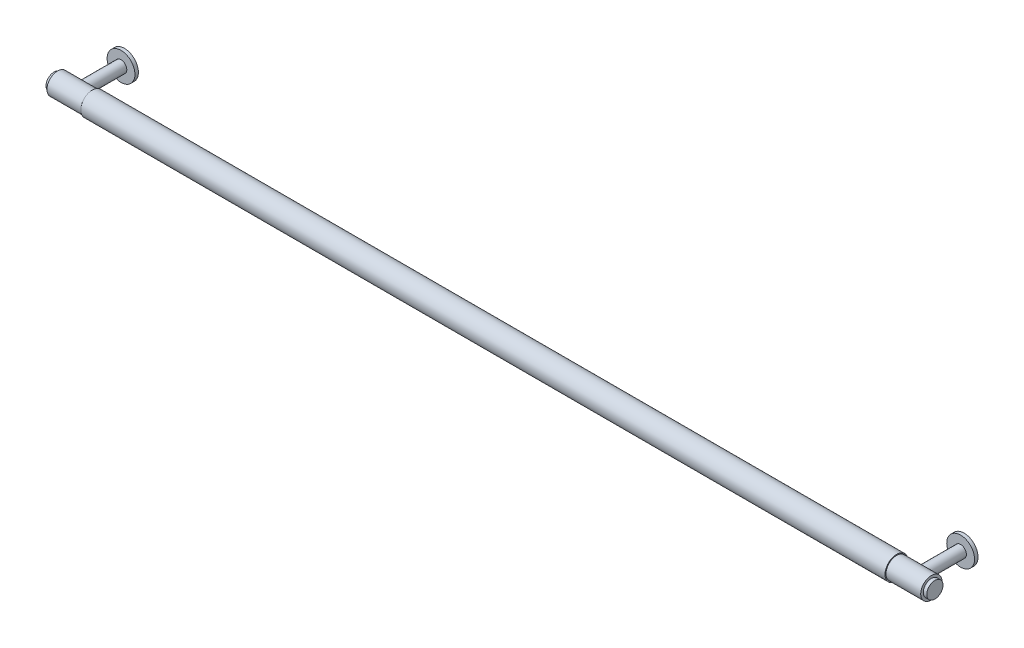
ISO-10303-21;
HEADER;
FILE_DESCRIPTION(('STEP AP214'),'2;1');
FILE_NAME('part.step','',(''),(''),'','','');
FILE_SCHEMA(('AUTOMOTIVE_DESIGN { 1 0 10303 214 1 1 1 1 }'));
ENDSEC;
DATA;
#1=APPLICATION_CONTEXT('core data for automotive mechanical design processes');
#2=APPLICATION_PROTOCOL_DEFINITION('international standard','automotive_design',2000,#1);
#3=PRODUCT_CONTEXT('',#1,'mechanical');
#4=PRODUCT('Part','Part','',(#3));
#5=PRODUCT_RELATED_PRODUCT_CATEGORY('part','',(#4));
#6=PRODUCT_DEFINITION_FORMATION('','',#4);
#7=PRODUCT_DEFINITION_CONTEXT('part definition',#1,'design');
#8=PRODUCT_DEFINITION('design','',#6,#7);
#9=PRODUCT_DEFINITION_SHAPE('','',#8);
#10=(LENGTH_UNIT() NAMED_UNIT(*) SI_UNIT(.MILLI.,.METRE.));
#11=(NAMED_UNIT(*) PLANE_ANGLE_UNIT() SI_UNIT($,.RADIAN.));
#12=(NAMED_UNIT(*) SI_UNIT($,.STERADIAN.) SOLID_ANGLE_UNIT());
#13=UNCERTAINTY_MEASURE_WITH_UNIT(LENGTH_MEASURE(1.E-05),#10,'distance_accuracy_value','');
#14=(GEOMETRIC_REPRESENTATION_CONTEXT(3) GLOBAL_UNCERTAINTY_ASSIGNED_CONTEXT((#13)) GLOBAL_UNIT_ASSIGNED_CONTEXT((#10,
#11,#12)) REPRESENTATION_CONTEXT('',''));
#15=CARTESIAN_POINT('',(0.,0.,0.));
#16=DIRECTION('',(0.,0.,1.));
#17=DIRECTION('',(1.,0.,0.));
#18=AXIS2_PLACEMENT_3D('',#15,#16,#17);
#19=CARTESIAN_POINT('',(377.,0.,0.));
#20=DIRECTION('',(-1.,0.,0.));
#21=DIRECTION('',(0.,0.,1.));
#22=AXIS2_PLACEMENT_3D('',#19,#20,#21);
#23=CYLINDRICAL_SURFACE('',#22,9.2);
#24=CARTESIAN_POINT('',(347.,0.,0.));
#25=DIRECTION('',(1.,0.,0.));
#26=DIRECTION('',(0.,0.,-1.));
#27=AXIS2_PLACEMENT_3D('',#24,#25,#26);
#28=CIRCLE('',#27,9.2);
#29=CARTESIAN_POINT('',(347.,0.,-9.2));
#30=VERTEX_POINT('',#29);
#31=EDGE_CURVE('E110',#30,#30,#28,.T.);
#32=ORIENTED_EDGE('',*,*,#31,.T.);
#33=EDGE_LOOP('',(#32));
#34=FACE_BOUND('',#33,.T.);
#35=CARTESIAN_POINT('',(377.,0.,0.));
#36=DIRECTION('',(1.,0.,0.));
#37=DIRECTION('',(0.,0.,-1.));
#38=AXIS2_PLACEMENT_3D('',#35,#36,#37);
#39=CIRCLE('',#38,9.2);
#40=CARTESIAN_POINT('',(377.,0.,-9.2));
#41=VERTEX_POINT('',#40);
#42=EDGE_CURVE('E111',#41,#41,#39,.T.);
#43=ORIENTED_EDGE('',*,*,#42,.F.);
#44=EDGE_LOOP('',(#43));
#45=FACE_BOUND('',#44,.T.);
#46=CARTESIAN_POINT('',(367.25,0.,-9.2));
#47=CARTESIAN_POINT('',(367.250001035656,-0.130074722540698,-9.20000090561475));
#48=CARTESIAN_POINT('',(367.244919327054,-0.260136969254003,-9.19723589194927));
#49=CARTESIAN_POINT('',(367.224659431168,-0.519285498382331,-9.18624856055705));
#50=CARTESIAN_POINT('',(367.209478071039,-0.648371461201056,-9.17802452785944));
#51=CARTESIAN_POINT('',(367.169189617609,-0.904665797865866,-9.15631689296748));
#52=CARTESIAN_POINT('',(367.144072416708,-1.03187212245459,-9.14282793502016));
#53=CARTESIAN_POINT('',(367.084208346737,-1.28341476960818,-9.11092364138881));
#54=CARTESIAN_POINT('',(367.04945754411,-1.40774989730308,-9.0925062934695));
#55=CARTESIAN_POINT('',(366.970895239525,-1.65213298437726,-9.05128374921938));
#56=CARTESIAN_POINT('',(366.927125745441,-1.77219789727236,-9.02849892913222));
#57=CARTESIAN_POINT('',(366.830864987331,-2.00796183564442,-8.9790104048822));
#58=CARTESIAN_POINT('',(366.778370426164,-2.12365919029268,-8.95230521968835));
#59=CARTESIAN_POINT('',(366.608525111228,-2.46316888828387,-8.86719116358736));
#60=CARTESIAN_POINT('',(366.478734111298,-2.67964052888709,-8.80374126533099));
#61=CARTESIAN_POINT('',(366.179944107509,-3.10276985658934,-8.66405646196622));
#62=CARTESIAN_POINT('',(366.008884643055,-3.30776927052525,-8.58724663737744));
#63=CARTESIAN_POINT('',(365.636938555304,-3.68774436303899,-8.4310608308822));
#64=CARTESIAN_POINT('',(365.436025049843,-3.86269267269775,-8.35168258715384));
#65=CARTESIAN_POINT('',(364.986960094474,-4.19453179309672,-8.19042783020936));
#66=CARTESIAN_POINT('',(364.736128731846,-4.34809630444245,-8.10903821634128));
#67=CARTESIAN_POINT('',(364.340003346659,-4.54463175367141,-7.99949849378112));
#68=CARTESIAN_POINT('',(364.204600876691,-4.60452242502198,-7.96506681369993));
#69=CARTESIAN_POINT('',(363.927917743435,-4.71238739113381,-7.90172843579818));
#70=CARTESIAN_POINT('',(363.786640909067,-4.76036931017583,-7.87281820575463));
#71=CARTESIAN_POINT('',(363.508188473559,-4.84114175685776,-7.82339132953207));
#72=CARTESIAN_POINT('',(363.371306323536,-4.87469290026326,-7.80246375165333));
#73=CARTESIAN_POINT('',(363.094408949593,-4.9302019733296,-7.76750851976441));
#74=CARTESIAN_POINT('',(362.954395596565,-4.95216664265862,-7.75347685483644));
#75=CARTESIAN_POINT('',(362.67258350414,-4.98412633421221,-7.73297147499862));
#76=CARTESIAN_POINT('',(362.530786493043,-4.99413215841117,-7.72649093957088));
#77=CARTESIAN_POINT('',(362.246722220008,-5.0020165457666,-7.72138953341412));
#78=CARTESIAN_POINT('',(362.104455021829,-4.99989669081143,-7.72276763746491));
#79=CARTESIAN_POINT('',(361.841925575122,-4.98478878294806,-7.73252471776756));
#80=CARTESIAN_POINT('',(361.721523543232,-4.97345607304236,-7.73983711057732));
#81=CARTESIAN_POINT('',(361.482260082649,-4.94217921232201,-7.75984601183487));
#82=CARTESIAN_POINT('',(361.363399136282,-4.92223242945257,-7.77254416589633));
#83=CARTESIAN_POINT('',(361.12803831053,-4.87397481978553,-7.80289558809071));
#84=CARTESIAN_POINT('',(361.011538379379,-4.84566417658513,-7.82054874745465));
#85=CARTESIAN_POINT('',(360.781543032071,-4.7809962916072,-7.86024868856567));
#86=CARTESIAN_POINT('',(360.668048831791,-4.7446358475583,-7.88229721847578));
#87=CARTESIAN_POINT('',(360.328154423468,-4.62225510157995,-7.95511924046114));
#88=CARTESIAN_POINT('',(360.107319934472,-4.52396510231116,-8.01188661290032));
#89=CARTESIAN_POINT('',(359.684260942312,-4.29821090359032,-8.1352249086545));
#90=CARTESIAN_POINT('',(359.482044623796,-4.17073395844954,-8.2018001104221));
#91=CARTESIAN_POINT('',(359.069163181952,-3.86749973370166,-8.34955553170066));
#92=CARTESIAN_POINT('',(358.86196454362,-3.68733528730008,-8.43140910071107));
#93=CARTESIAN_POINT('',(358.479057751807,-3.29471585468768,-8.59242600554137));
#94=CARTESIAN_POINT('',(358.303370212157,-3.08223989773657,-8.67158755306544));
#95=CARTESIAN_POINT('',(358.061812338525,-2.73508983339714,-8.78495686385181));
#96=CARTESIAN_POINT('',(357.982990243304,-2.61045949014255,-8.82288451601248));
#97=CARTESIAN_POINT('',(357.836257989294,-2.35386813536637,-8.89477478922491));
#98=CARTESIAN_POINT('',(357.768343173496,-2.22191028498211,-8.92873910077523));
#99=CARTESIAN_POINT('',(357.644183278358,-1.95155644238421,-8.99170105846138));
#100=CARTESIAN_POINT('',(357.587932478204,-1.81316364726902,-9.02070113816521));
#101=CARTESIAN_POINT('',(357.487782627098,-1.53091383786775,-9.07286528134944));
#102=CARTESIAN_POINT('',(357.443881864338,-1.38705758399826,-9.09603015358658));
#103=CARTESIAN_POINT('',(357.372513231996,-1.10853590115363,-9.13395050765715));
#104=CARTESIAN_POINT('',(357.343906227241,-0.97424021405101,-9.14928303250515));
#105=CARTESIAN_POINT('',(357.297792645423,-0.70322778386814,-9.17409277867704));
#106=CARTESIAN_POINT('',(357.280284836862,-0.56651131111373,-9.18357064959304));
#107=CARTESIAN_POINT('',(357.256625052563,-0.291879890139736,-9.19639574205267));
#108=CARTESIAN_POINT('',(357.250467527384,-0.153965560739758,-9.19974595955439));
#109=CARTESIAN_POINT('',(357.249583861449,0.121906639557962,-9.20022611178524));
#110=CARTESIAN_POINT('',(357.25485701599,0.259864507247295,-9.19735642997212));
#111=CARTESIAN_POINT('',(357.275708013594,0.521504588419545,-9.18605000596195));
#112=CARTESIAN_POINT('',(357.290256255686,0.645294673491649,-9.17816969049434));
#113=CARTESIAN_POINT('',(357.328472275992,0.891088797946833,-9.15757479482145));
#114=CARTESIAN_POINT('',(357.352142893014,1.01309226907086,-9.1448587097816));
#115=CARTESIAN_POINT('',(357.408333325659,1.25443425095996,-9.11488727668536));
#116=CARTESIAN_POINT('',(357.440850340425,1.37377359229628,-9.09763336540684));
#117=CARTESIAN_POINT('',(357.514396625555,1.60912592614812,-9.05897178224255));
#118=CARTESIAN_POINT('',(357.555429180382,1.72513761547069,-9.0375625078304));
#119=CARTESIAN_POINT('',(357.692832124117,2.07244825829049,-8.9666859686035));
#120=CARTESIAN_POINT('',(357.80222449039,2.29754525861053,-8.91127618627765));
#121=CARTESIAN_POINT('',(358.051555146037,2.72668339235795,-8.78949008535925));
#122=CARTESIAN_POINT('',(358.191504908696,2.93071657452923,-8.72310964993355));
#123=CARTESIAN_POINT('',(358.515646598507,3.33604084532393,-8.5768397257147));
#124=CARTESIAN_POINT('',(358.703016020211,3.53454639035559,-8.49626779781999));
#125=CARTESIAN_POINT('',(359.107841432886,3.89884933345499,-8.33538773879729));
#126=CARTESIAN_POINT('',(359.325327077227,4.06461409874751,-8.25507994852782));
#127=CARTESIAN_POINT('',(359.679615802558,4.29124185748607,-8.13837911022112));
#128=CARTESIAN_POINT('',(359.807207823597,4.36516170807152,-8.0988551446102));
#129=CARTESIAN_POINT('',(360.069309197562,4.50182228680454,-8.02369412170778));
#130=CARTESIAN_POINT('',(360.203815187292,4.56456838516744,-7.98805520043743));
#131=CARTESIAN_POINT('',(360.478867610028,4.67816332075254,-7.92206455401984));
#132=CARTESIAN_POINT('',(360.619408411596,4.72902297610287,-7.89170802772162));
#133=CARTESIAN_POINT('',(360.905644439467,4.81821167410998,-7.83757391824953));
#134=CARTESIAN_POINT('',(361.051338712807,4.85654302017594,-7.81379512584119));
#135=CARTESIAN_POINT('',(361.332218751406,4.91693572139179,-7.77591708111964));
#136=CARTESIAN_POINT('',(361.467045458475,4.94021834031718,-7.76110050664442));
#137=CARTESIAN_POINT('',(361.738723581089,4.9756762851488,-7.7384167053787));
#138=CARTESIAN_POINT('',(361.875574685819,4.98785329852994,-7.73054842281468));
#139=CARTESIAN_POINT('',(362.149954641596,5.00088423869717,-7.72212521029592));
#140=CARTESIAN_POINT('',(362.287483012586,5.0017452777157,-7.72156568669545));
#141=CARTESIAN_POINT('',(362.561968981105,4.99214702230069,-7.72777464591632));
#142=CARTESIAN_POINT('',(362.698926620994,4.98168858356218,-7.73454257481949));
#143=CARTESIAN_POINT('',(362.953194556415,4.95173663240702,-7.7537456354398));
#144=CARTESIAN_POINT('',(363.070732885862,4.93360287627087,-7.7653243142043));
#145=CARTESIAN_POINT('',(363.303669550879,4.88915719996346,-7.79338335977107));
#146=CARTESIAN_POINT('',(363.419067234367,4.86284282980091,-7.8098651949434));
#147=CARTESIAN_POINT('',(363.760997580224,4.77204459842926,-7.86592091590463));
#148=CARTESIAN_POINT('',(363.983409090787,4.69568852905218,-7.91211668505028));
#149=CARTESIAN_POINT('',(364.426159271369,4.50841400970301,-8.02038246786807));
#150=CARTESIAN_POINT('',(364.64549505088,4.3956298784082,-8.08326570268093));
#151=CARTESIAN_POINT('',(365.063636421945,4.14046696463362,-8.21688922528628));
#152=CARTESIAN_POINT('',(365.262430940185,3.99807234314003,-8.28763370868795));
#153=CARTESIAN_POINT('',(365.665342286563,3.66254871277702,-8.44184811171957));
#154=CARTESIAN_POINT('',(365.86567297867,3.46499766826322,-8.52561746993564));
#155=CARTESIAN_POINT('',(366.231654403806,3.03735701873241,-8.68715056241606));
#156=CARTESIAN_POINT('',(366.397281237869,2.8072451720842,-8.76491013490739));
#157=CARTESIAN_POINT('',(366.61800821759,2.43762496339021,-8.87216065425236));
#158=CARTESIAN_POINT('',(366.687800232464,2.30818012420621,-8.90679581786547));
#159=CARTESIAN_POINT('',(366.816072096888,2.04271439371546,-8.97139528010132));
#160=CARTESIAN_POINT('',(366.874557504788,1.90669677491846,-9.00136187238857));
#161=CARTESIAN_POINT('',(366.979411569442,1.62929850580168,-9.05567934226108));
#162=CARTESIAN_POINT('',(367.025803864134,1.48792894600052,-9.0800411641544));
#163=CARTESIAN_POINT('',(367.10595335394,1.20079805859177,-9.12245171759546));
#164=CARTESIAN_POINT('',(367.139717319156,1.05503912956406,-9.1405038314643));
#165=CARTESIAN_POINT('',(367.194445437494,0.758588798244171,-9.16989641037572));
#166=CARTESIAN_POINT('',(367.215246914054,0.607858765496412,-9.18115152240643));
#167=CARTESIAN_POINT('',(367.243023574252,0.304746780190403,-9.19620277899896));
#168=CARTESIAN_POINT('',(367.24999878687,0.152364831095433,-9.1999989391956));
#169=CARTESIAN_POINT('',(367.25,0.,-9.2));
#170=B_SPLINE_CURVE_WITH_KNOTS('',3,(#46,#47,#48,#49,#50,#51,#52,#53,#54,#55,#56,#57,#58,#59,
#60,#61,#62,#63,#64,#65,#66,#67,#68,#69,#70,#71,#72,#73,#74,#75,#76,#77,#78,#79,#80,#81,#82,#83,
#84,#85,#86,#87,#88,#89,#90,#91,#92,#93,#94,#95,#96,#97,#98,#99,#100,#101,#102,#103,#104,#105,
#106,#107,#108,#109,#110,#111,#112,#113,#114,#115,#116,#117,#118,#119,#120,#121,#122,#123,#124,
#125,#126,#127,#128,#129,#130,#131,#132,#133,#134,#135,#136,#137,#138,#139,#140,#141,#142,#143,
#144,#145,#146,#147,#148,#149,#150,#151,#152,#153,#154,#155,#156,#157,#158,#159,#160,#161,#162,
#163,#164,#165,#166,#167,#168,#169),.UNSPECIFIED.,.T.,.F.,(4,2,2,2,2,2,2,2,2,2,2,2,2,2,2,2,2,2,
2,2,2,2,2,2,2,2,2,2,2,2,2,2,2,2,2,2,2,2,2,2,2,2,2,2,2,2,2,2,2,2,2,2,2,2,2,2,2,2,2,2,2,4),(0.,
0.390074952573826,0.780272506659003,1.17086802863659,1.56162327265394,1.9505979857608,
2.33972002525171,3.11719990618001,3.94734927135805,4.77825072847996,5.68860389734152,
6.1440790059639,6.59926175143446,7.02606566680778,7.45262104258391,7.87879083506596,
8.30490503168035,8.66793889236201,9.03108375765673,9.39422065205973,9.75750226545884,
10.4992817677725,11.2413858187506,12.0973849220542,12.9539419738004,13.4102132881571,
13.8662892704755,14.3221410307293,14.7779295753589,15.1918463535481,15.6057171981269,
16.0193856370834,16.4330285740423,16.8072633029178,17.1816145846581,17.5558474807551,
17.9302249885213,18.6957960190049,19.4616549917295,20.3120011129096,21.1631905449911,
21.6206680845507,22.0779251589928,22.5347644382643,22.9915196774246,23.4037762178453,
23.815970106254,24.2279049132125,24.6398085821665,24.9978688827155,25.3560365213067,
26.0719476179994,26.8327119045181,27.5938841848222,28.4707847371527,29.3482872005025,
29.8010085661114,30.2535068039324,30.7051138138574,31.1564783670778,31.6133990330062,
32.0703187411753),.UNSPECIFIED.);
#171=CARTESIAN_POINT('',(367.25,0.,-9.2));
#172=VERTEX_POINT('',#171);
#173=EDGE_CURVE('E10',#172,#172,#170,.T.);
#174=ORIENTED_EDGE('',*,*,#173,.F.);
#175=EDGE_LOOP('',(#174));
#176=FACE_BOUND('',#175,.T.);
#177=ADVANCED_FACE('F31',(#34,#45,#176),#23,.T.);
#178=CARTESIAN_POINT('',(377.,0.,0.));
#179=DIRECTION('',(1.,0.,0.));
#180=DIRECTION('',(0.,0.,-1.));
#181=AXIS2_PLACEMENT_3D('',#178,#179,#180);
#182=PLANE('',#181);
#183=ORIENTED_EDGE('',*,*,#42,.T.);
#184=EDGE_LOOP('',(#183));
#185=FACE_BOUND('',#184,.T.);
#186=CARTESIAN_POINT('',(377.,0.,0.));
#187=DIRECTION('',(1.,0.,0.));
#188=DIRECTION('',(0.,0.,-1.));
#189=AXIS2_PLACEMENT_3D('',#186,#187,#188);
#190=CIRCLE('',#189,7.);
#191=CARTESIAN_POINT('',(377.,0.,-7.));
#192=VERTEX_POINT('',#191);
#193=EDGE_CURVE('E117',#192,#192,#190,.T.);
#194=ORIENTED_EDGE('',*,*,#193,.F.);
#195=EDGE_LOOP('',(#194));
#196=FACE_BOUND('',#195,.T.);
#197=ADVANCED_FACE('F86',(#185,#196),#182,.T.);
#198=CARTESIAN_POINT('',(347.,0.,0.));
#199=DIRECTION('',(1.,0.,0.));
#200=DIRECTION('',(0.,0.,-1.));
#201=AXIS2_PLACEMENT_3D('',#198,#199,#200);
#202=PLANE('',#201);
#203=CARTESIAN_POINT('',(347.,0.,0.));
#204=DIRECTION('',(1.,0.,0.));
#205=DIRECTION('',(0.,0.,-1.));
#206=AXIS2_PLACEMENT_3D('',#203,#204,#205);
#207=CIRCLE('',#206,10.);
#208=CARTESIAN_POINT('',(347.,0.,-10.));
#209=VERTEX_POINT('',#208);
#210=EDGE_CURVE('E108',#209,#209,#207,.T.);
#211=ORIENTED_EDGE('',*,*,#210,.T.);
#212=EDGE_LOOP('',(#211));
#213=FACE_BOUND('',#212,.T.);
#214=ORIENTED_EDGE('',*,*,#31,.F.);
#215=EDGE_LOOP('',(#214));
#216=FACE_BOUND('',#215,.T.);
#217=ADVANCED_FACE('F91',(#213,#216),#202,.T.);
#218=CARTESIAN_POINT('',(347.,0.,0.));
#219=DIRECTION('',(-1.,0.,0.));
#220=DIRECTION('',(0.,0.,1.));
#221=AXIS2_PLACEMENT_3D('',#218,#219,#220);
#222=CYLINDRICAL_SURFACE('',#221,10.);
#223=ORIENTED_EDGE('',*,*,#210,.F.);
#224=EDGE_LOOP('',(#223));
#225=FACE_BOUND('',#224,.T.);
#226=CARTESIAN_POINT('',(-347.,0.,0.));
#227=DIRECTION('',(1.,0.,0.));
#228=DIRECTION('',(0.,0.,-1.));
#229=AXIS2_PLACEMENT_3D('',#226,#227,#228);
#230=CIRCLE('',#229,10.);
#231=CARTESIAN_POINT('',(-347.,0.,-10.));
#232=VERTEX_POINT('',#231);
#233=EDGE_CURVE('E130',#232,#232,#230,.T.);
#234=ORIENTED_EDGE('',*,*,#233,.T.);
#235=EDGE_LOOP('',(#234));
#236=FACE_BOUND('',#235,.T.);
#237=ADVANCED_FACE('F33',(#225,#236),#222,.T.);
#238=CARTESIAN_POINT('',(380.,0.,0.));
#239=DIRECTION('',(-1.,0.,0.));
#240=DIRECTION('',(0.,0.,1.));
#241=AXIS2_PLACEMENT_3D('',#238,#239,#240);
#242=CYLINDRICAL_SURFACE('',#241,7.);
#243=CARTESIAN_POINT('',(380.,0.,0.));
#244=DIRECTION('',(1.,0.,0.));
#245=DIRECTION('',(0.,0.,-1.));
#246=AXIS2_PLACEMENT_3D('',#243,#244,#245);
#247=CIRCLE('',#246,7.);
#248=CARTESIAN_POINT('',(380.,0.,-7.));
#249=VERTEX_POINT('',#248);
#250=EDGE_CURVE('E112',#249,#249,#247,.T.);
#251=ORIENTED_EDGE('',*,*,#250,.F.);
#252=EDGE_LOOP('',(#251));
#253=FACE_BOUND('',#252,.T.);
#254=ORIENTED_EDGE('',*,*,#193,.T.);
#255=EDGE_LOOP('',(#254));
#256=FACE_BOUND('',#255,.T.);
#257=ADVANCED_FACE('F103',(#253,#256),#242,.T.);
#258=CARTESIAN_POINT('',(380.,0.,0.));
#259=DIRECTION('',(1.,0.,0.));
#260=DIRECTION('',(0.,0.,-1.));
#261=AXIS2_PLACEMENT_3D('',#258,#259,#260);
#262=PLANE('',#261);
#263=ORIENTED_EDGE('',*,*,#250,.T.);
#264=EDGE_LOOP('',(#263));
#265=FACE_BOUND('',#264,.T.);
#266=ADVANCED_FACE('F127',(#265),#262,.T.);
#267=CARTESIAN_POINT('',(-347.,0.,0.));
#268=DIRECTION('',(-1.,0.,0.));
#269=DIRECTION('',(0.,0.,-1.));
#270=AXIS2_PLACEMENT_3D('',#267,#268,#269);
#271=PLANE('',#270);
#272=CARTESIAN_POINT('',(-347.,0.,0.));
#273=DIRECTION('',(-1.,0.,0.));
#274=DIRECTION('',(0.,0.,1.));
#275=AXIS2_PLACEMENT_3D('',#272,#273,#274);
#276=CIRCLE('',#275,9.2);
#277=CARTESIAN_POINT('',(-347.,0.,9.2));
#278=VERTEX_POINT('',#277);
#279=EDGE_CURVE('E50',#278,#278,#276,.T.);
#280=ORIENTED_EDGE('',*,*,#279,.F.);
#281=EDGE_LOOP('',(#280));
#282=FACE_BOUND('',#281,.T.);
#283=ORIENTED_EDGE('',*,*,#233,.F.);
#284=EDGE_LOOP('',(#283));
#285=FACE_BOUND('',#284,.T.);
#286=ADVANCED_FACE('F81',(#282,#285),#271,.T.);
#287=CARTESIAN_POINT('',(-377.,0.,0.));
#288=DIRECTION('',(1.,0.,0.));
#289=DIRECTION('',(0.,0.,-1.));
#290=AXIS2_PLACEMENT_3D('',#287,#288,#289);
#291=CYLINDRICAL_SURFACE('',#290,9.2);
#292=CARTESIAN_POINT('',(-367.25,0.,-9.2));
#293=CARTESIAN_POINT('',(-367.250001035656,0.130074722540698,-9.20000090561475));
#294=CARTESIAN_POINT('',(-367.244919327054,0.260136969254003,-9.19723589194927));
#295=CARTESIAN_POINT('',(-367.224659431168,0.519285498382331,-9.18624856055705));
#296=CARTESIAN_POINT('',(-367.209478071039,0.648371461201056,-9.17802452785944));
#297=CARTESIAN_POINT('',(-367.169189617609,0.904665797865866,-9.15631689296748));
#298=CARTESIAN_POINT('',(-367.144072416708,1.03187212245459,-9.14282793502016));
#299=CARTESIAN_POINT('',(-367.084208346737,1.28341476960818,-9.11092364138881));
#300=CARTESIAN_POINT('',(-367.04945754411,1.40774989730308,-9.0925062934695));
#301=CARTESIAN_POINT('',(-366.970895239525,1.65213298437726,-9.05128374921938));
#302=CARTESIAN_POINT('',(-366.927125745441,1.77219789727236,-9.02849892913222));
#303=CARTESIAN_POINT('',(-366.830864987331,2.00796183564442,-8.9790104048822));
#304=CARTESIAN_POINT('',(-366.778370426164,2.12365919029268,-8.95230521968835));
#305=CARTESIAN_POINT('',(-366.608525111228,2.46316888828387,-8.86719116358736));
#306=CARTESIAN_POINT('',(-366.478734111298,2.67964052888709,-8.80374126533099));
#307=CARTESIAN_POINT('',(-366.179944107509,3.10276985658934,-8.66405646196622));
#308=CARTESIAN_POINT('',(-366.008884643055,3.30776927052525,-8.58724663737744));
#309=CARTESIAN_POINT('',(-365.636938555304,3.68774436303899,-8.4310608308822));
#310=CARTESIAN_POINT('',(-365.436025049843,3.86269267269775,-8.35168258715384));
#311=CARTESIAN_POINT('',(-364.986960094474,4.19453179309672,-8.19042783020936));
#312=CARTESIAN_POINT('',(-364.736128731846,4.34809630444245,-8.10903821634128));
#313=CARTESIAN_POINT('',(-364.340003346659,4.54463175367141,-7.99949849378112));
#314=CARTESIAN_POINT('',(-364.204600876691,4.60452242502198,-7.96506681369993));
#315=CARTESIAN_POINT('',(-363.927917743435,4.71238739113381,-7.90172843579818));
#316=CARTESIAN_POINT('',(-363.786640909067,4.76036931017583,-7.87281820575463));
#317=CARTESIAN_POINT('',(-363.508188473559,4.84114175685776,-7.82339132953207));
#318=CARTESIAN_POINT('',(-363.371306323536,4.87469290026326,-7.80246375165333));
#319=CARTESIAN_POINT('',(-363.094408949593,4.9302019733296,-7.76750851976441));
#320=CARTESIAN_POINT('',(-362.954395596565,4.95216664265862,-7.75347685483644));
#321=CARTESIAN_POINT('',(-362.67258350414,4.98412633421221,-7.73297147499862));
#322=CARTESIAN_POINT('',(-362.530786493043,4.99413215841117,-7.72649093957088));
#323=CARTESIAN_POINT('',(-362.246722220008,5.0020165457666,-7.72138953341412));
#324=CARTESIAN_POINT('',(-362.104455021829,4.99989669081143,-7.72276763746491));
#325=CARTESIAN_POINT('',(-361.841925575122,4.98478878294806,-7.73252471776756));
#326=CARTESIAN_POINT('',(-361.721523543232,4.97345607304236,-7.73983711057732));
#327=CARTESIAN_POINT('',(-361.482260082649,4.94217921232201,-7.75984601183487));
#328=CARTESIAN_POINT('',(-361.363399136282,4.92223242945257,-7.77254416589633));
#329=CARTESIAN_POINT('',(-361.12803831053,4.87397481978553,-7.80289558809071));
#330=CARTESIAN_POINT('',(-361.011538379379,4.84566417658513,-7.82054874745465));
#331=CARTESIAN_POINT('',(-360.781543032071,4.7809962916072,-7.86024868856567));
#332=CARTESIAN_POINT('',(-360.668048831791,4.7446358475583,-7.88229721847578));
#333=CARTESIAN_POINT('',(-360.328154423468,4.62225510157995,-7.95511924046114));
#334=CARTESIAN_POINT('',(-360.107319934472,4.52396510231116,-8.01188661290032));
#335=CARTESIAN_POINT('',(-359.684260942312,4.29821090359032,-8.1352249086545));
#336=CARTESIAN_POINT('',(-359.482044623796,4.17073395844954,-8.2018001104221));
#337=CARTESIAN_POINT('',(-359.069163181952,3.86749973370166,-8.34955553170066));
#338=CARTESIAN_POINT('',(-358.86196454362,3.68733528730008,-8.43140910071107));
#339=CARTESIAN_POINT('',(-358.479057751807,3.29471585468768,-8.59242600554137));
#340=CARTESIAN_POINT('',(-358.303370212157,3.08223989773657,-8.67158755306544));
#341=CARTESIAN_POINT('',(-358.061812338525,2.73508983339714,-8.78495686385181));
#342=CARTESIAN_POINT('',(-357.982990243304,2.61045949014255,-8.82288451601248));
#343=CARTESIAN_POINT('',(-357.836257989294,2.35386813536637,-8.89477478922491));
#344=CARTESIAN_POINT('',(-357.768343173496,2.22191028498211,-8.92873910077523));
#345=CARTESIAN_POINT('',(-357.644183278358,1.95155644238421,-8.99170105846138));
#346=CARTESIAN_POINT('',(-357.587932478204,1.81316364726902,-9.02070113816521));
#347=CARTESIAN_POINT('',(-357.487782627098,1.53091383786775,-9.07286528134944));
#348=CARTESIAN_POINT('',(-357.443881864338,1.38705758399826,-9.09603015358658));
#349=CARTESIAN_POINT('',(-357.372513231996,1.10853590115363,-9.13395050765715));
#350=CARTESIAN_POINT('',(-357.343906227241,0.97424021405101,-9.14928303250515));
#351=CARTESIAN_POINT('',(-357.297792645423,0.70322778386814,-9.17409277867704));
#352=CARTESIAN_POINT('',(-357.280284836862,0.56651131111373,-9.18357064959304));
#353=CARTESIAN_POINT('',(-357.256625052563,0.291879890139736,-9.19639574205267));
#354=CARTESIAN_POINT('',(-357.250467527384,0.153965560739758,-9.19974595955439));
#355=CARTESIAN_POINT('',(-357.249583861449,-0.121906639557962,-9.20022611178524));
#356=CARTESIAN_POINT('',(-357.25485701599,-0.259864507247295,-9.19735642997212));
#357=CARTESIAN_POINT('',(-357.275708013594,-0.521504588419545,-9.18605000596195));
#358=CARTESIAN_POINT('',(-357.290256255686,-0.645294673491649,-9.17816969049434));
#359=CARTESIAN_POINT('',(-357.328472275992,-0.891088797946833,-9.15757479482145));
#360=CARTESIAN_POINT('',(-357.352142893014,-1.01309226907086,-9.1448587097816));
#361=CARTESIAN_POINT('',(-357.408333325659,-1.25443425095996,-9.11488727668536));
#362=CARTESIAN_POINT('',(-357.440850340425,-1.37377359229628,-9.09763336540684));
#363=CARTESIAN_POINT('',(-357.514396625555,-1.60912592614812,-9.05897178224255));
#364=CARTESIAN_POINT('',(-357.555429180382,-1.72513761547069,-9.0375625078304));
#365=CARTESIAN_POINT('',(-357.692832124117,-2.07244825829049,-8.9666859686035));
#366=CARTESIAN_POINT('',(-357.80222449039,-2.29754525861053,-8.91127618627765));
#367=CARTESIAN_POINT('',(-358.051555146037,-2.72668339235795,-8.78949008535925));
#368=CARTESIAN_POINT('',(-358.191504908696,-2.93071657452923,-8.72310964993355));
#369=CARTESIAN_POINT('',(-358.515646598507,-3.33604084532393,-8.5768397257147));
#370=CARTESIAN_POINT('',(-358.703016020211,-3.53454639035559,-8.49626779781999));
#371=CARTESIAN_POINT('',(-359.107841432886,-3.89884933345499,-8.33538773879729));
#372=CARTESIAN_POINT('',(-359.325327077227,-4.06461409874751,-8.25507994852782));
#373=CARTESIAN_POINT('',(-359.679615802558,-4.29124185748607,-8.13837911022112));
#374=CARTESIAN_POINT('',(-359.807207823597,-4.36516170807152,-8.0988551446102));
#375=CARTESIAN_POINT('',(-360.069309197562,-4.50182228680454,-8.02369412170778));
#376=CARTESIAN_POINT('',(-360.203815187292,-4.56456838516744,-7.98805520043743));
#377=CARTESIAN_POINT('',(-360.478867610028,-4.67816332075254,-7.92206455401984));
#378=CARTESIAN_POINT('',(-360.619408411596,-4.72902297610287,-7.89170802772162));
#379=CARTESIAN_POINT('',(-360.905644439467,-4.81821167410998,-7.83757391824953));
#380=CARTESIAN_POINT('',(-361.051338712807,-4.85654302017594,-7.81379512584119));
#381=CARTESIAN_POINT('',(-361.332218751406,-4.91693572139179,-7.77591708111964));
#382=CARTESIAN_POINT('',(-361.467045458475,-4.94021834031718,-7.76110050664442));
#383=CARTESIAN_POINT('',(-361.738723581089,-4.9756762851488,-7.7384167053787));
#384=CARTESIAN_POINT('',(-361.875574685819,-4.98785329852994,-7.73054842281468));
#385=CARTESIAN_POINT('',(-362.149954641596,-5.00088423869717,-7.72212521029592));
#386=CARTESIAN_POINT('',(-362.287483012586,-5.0017452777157,-7.72156568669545));
#387=CARTESIAN_POINT('',(-362.561968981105,-4.99214702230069,-7.72777464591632));
#388=CARTESIAN_POINT('',(-362.698926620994,-4.98168858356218,-7.73454257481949));
#389=CARTESIAN_POINT('',(-362.953194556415,-4.95173663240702,-7.7537456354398));
#390=CARTESIAN_POINT('',(-363.070732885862,-4.93360287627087,-7.7653243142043));
#391=CARTESIAN_POINT('',(-363.303669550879,-4.88915719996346,-7.79338335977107));
#392=CARTESIAN_POINT('',(-363.419067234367,-4.86284282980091,-7.8098651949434));
#393=CARTESIAN_POINT('',(-363.760997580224,-4.77204459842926,-7.86592091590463));
#394=CARTESIAN_POINT('',(-363.983409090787,-4.69568852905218,-7.91211668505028));
#395=CARTESIAN_POINT('',(-364.426159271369,-4.50841400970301,-8.02038246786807));
#396=CARTESIAN_POINT('',(-364.64549505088,-4.3956298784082,-8.08326570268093));
#397=CARTESIAN_POINT('',(-365.063636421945,-4.14046696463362,-8.21688922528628));
#398=CARTESIAN_POINT('',(-365.262430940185,-3.99807234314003,-8.28763370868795));
#399=CARTESIAN_POINT('',(-365.665342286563,-3.66254871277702,-8.44184811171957));
#400=CARTESIAN_POINT('',(-365.86567297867,-3.46499766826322,-8.52561746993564));
#401=CARTESIAN_POINT('',(-366.231654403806,-3.03735701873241,-8.68715056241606));
#402=CARTESIAN_POINT('',(-366.397281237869,-2.8072451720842,-8.76491013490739));
#403=CARTESIAN_POINT('',(-366.61800821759,-2.43762496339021,-8.87216065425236));
#404=CARTESIAN_POINT('',(-366.687800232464,-2.30818012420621,-8.90679581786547));
#405=CARTESIAN_POINT('',(-366.816072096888,-2.04271439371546,-8.97139528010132));
#406=CARTESIAN_POINT('',(-366.874557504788,-1.90669677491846,-9.00136187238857));
#407=CARTESIAN_POINT('',(-366.979411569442,-1.62929850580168,-9.05567934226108));
#408=CARTESIAN_POINT('',(-367.025803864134,-1.48792894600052,-9.0800411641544));
#409=CARTESIAN_POINT('',(-367.10595335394,-1.20079805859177,-9.12245171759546));
#410=CARTESIAN_POINT('',(-367.139717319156,-1.05503912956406,-9.1405038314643));
#411=CARTESIAN_POINT('',(-367.194445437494,-0.758588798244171,-9.16989641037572));
#412=CARTESIAN_POINT('',(-367.215246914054,-0.607858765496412,-9.18115152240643));
#413=CARTESIAN_POINT('',(-367.243023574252,-0.304746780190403,-9.19620277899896));
#414=CARTESIAN_POINT('',(-367.24999878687,-0.152364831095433,-9.1999989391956));
#415=CARTESIAN_POINT('',(-367.25,0.,-9.2));
#416=B_SPLINE_CURVE_WITH_KNOTS('',3,(#292,#293,#294,#295,#296,#297,#298,#299,#300,#301,#302,
#303,#304,#305,#306,#307,#308,#309,#310,#311,#312,#313,#314,#315,#316,#317,#318,#319,#320,#321,
#322,#323,#324,#325,#326,#327,#328,#329,#330,#331,#332,#333,#334,#335,#336,#337,#338,#339,#340,
#341,#342,#343,#344,#345,#346,#347,#348,#349,#350,#351,#352,#353,#354,#355,#356,#357,#358,#359,
#360,#361,#362,#363,#364,#365,#366,#367,#368,#369,#370,#371,#372,#373,#374,#375,#376,#377,#378,
#379,#380,#381,#382,#383,#384,#385,#386,#387,#388,#389,#390,#391,#392,#393,#394,#395,#396,#397,
#398,#399,#400,#401,#402,#403,#404,#405,#406,#407,#408,#409,#410,#411,#412,#413,#414,#415),
.UNSPECIFIED.,.T.,.F.,(4,2,2,2,2,2,2,2,2,2,2,2,2,2,2,2,2,2,2,2,2,2,2,2,2,2,2,2,2,2,2,2,2,2,2,2,
2,2,2,2,2,2,2,2,2,2,2,2,2,2,2,2,2,2,2,2,2,2,2,2,2,4),(0.,0.390074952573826,0.780272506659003,
1.17086802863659,1.56162327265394,1.9505979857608,2.33972002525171,3.11719990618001,
3.94734927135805,4.77825072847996,5.68860389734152,6.1440790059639,6.59926175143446,
7.02606566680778,7.45262104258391,7.87879083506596,8.30490503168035,8.66793889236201,
9.03108375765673,9.39422065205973,9.75750226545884,10.4992817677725,11.2413858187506,
12.0973849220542,12.9539419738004,13.4102132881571,13.8662892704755,14.3221410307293,
14.7779295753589,15.1918463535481,15.6057171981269,16.0193856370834,16.4330285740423,
16.8072633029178,17.1816145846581,17.5558474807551,17.9302249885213,18.6957960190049,
19.4616549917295,20.3120011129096,21.1631905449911,21.6206680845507,22.0779251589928,
22.5347644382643,22.9915196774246,23.4037762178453,23.815970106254,24.2279049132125,
24.6398085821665,24.9978688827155,25.3560365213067,26.0719476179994,26.8327119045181,
27.5938841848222,28.4707847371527,29.3482872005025,29.8010085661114,30.2535068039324,
30.7051138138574,31.1564783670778,31.6133990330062,32.0703187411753),.UNSPECIFIED.);
#417=CARTESIAN_POINT('',(-367.25,0.,-9.2));
#418=VERTEX_POINT('',#417);
#419=EDGE_CURVE('E42',#418,#418,#416,.T.);
#420=ORIENTED_EDGE('',*,*,#419,.F.);
#421=EDGE_LOOP('',(#420));
#422=FACE_BOUND('',#421,.T.);
#423=CARTESIAN_POINT('',(-377.,0.,0.));
#424=DIRECTION('',(1.,0.,0.));
#425=DIRECTION('',(0.,0.,-1.));
#426=AXIS2_PLACEMENT_3D('',#423,#424,#425);
#427=CIRCLE('',#426,9.2);
#428=CARTESIAN_POINT('',(-377.,0.,-9.2));
#429=VERTEX_POINT('',#428);
#430=EDGE_CURVE('E132',#429,#429,#427,.T.);
#431=ORIENTED_EDGE('',*,*,#430,.T.);
#432=EDGE_LOOP('',(#431));
#433=FACE_BOUND('',#432,.T.);
#434=ORIENTED_EDGE('',*,*,#279,.T.);
#435=EDGE_LOOP('',(#434));
#436=FACE_BOUND('',#435,.T.);
#437=ADVANCED_FACE('F57',(#422,#433,#436),#291,.T.);
#438=CARTESIAN_POINT('',(-377.,0.,0.));
#439=DIRECTION('',(-1.,0.,0.));
#440=DIRECTION('',(0.,0.,-1.));
#441=AXIS2_PLACEMENT_3D('',#438,#439,#440);
#442=PLANE('',#441);
#443=CARTESIAN_POINT('',(-377.,0.,0.));
#444=DIRECTION('',(-1.,0.,0.));
#445=DIRECTION('',(0.,0.,1.));
#446=AXIS2_PLACEMENT_3D('',#443,#444,#445);
#447=CIRCLE('',#446,7.);
#448=CARTESIAN_POINT('',(-377.,0.,7.));
#449=VERTEX_POINT('',#448);
#450=EDGE_CURVE('E46',#449,#449,#447,.T.);
#451=ORIENTED_EDGE('',*,*,#450,.F.);
#452=EDGE_LOOP('',(#451));
#453=FACE_BOUND('',#452,.T.);
#454=ORIENTED_EDGE('',*,*,#430,.F.);
#455=EDGE_LOOP('',(#454));
#456=FACE_BOUND('',#455,.T.);
#457=ADVANCED_FACE('F74',(#453,#456),#442,.T.);
#458=CARTESIAN_POINT('',(-380.,0.,0.));
#459=DIRECTION('',(1.,0.,0.));
#460=DIRECTION('',(0.,0.,-1.));
#461=AXIS2_PLACEMENT_3D('',#458,#459,#460);
#462=CYLINDRICAL_SURFACE('',#461,7.);
#463=CARTESIAN_POINT('',(-380.,0.,0.));
#464=DIRECTION('',(1.,0.,0.));
#465=DIRECTION('',(0.,0.,-1.));
#466=AXIS2_PLACEMENT_3D('',#463,#464,#465);
#467=CIRCLE('',#466,7.);
#468=CARTESIAN_POINT('',(-380.,0.,-7.));
#469=VERTEX_POINT('',#468);
#470=EDGE_CURVE('E136',#469,#469,#467,.T.);
#471=ORIENTED_EDGE('',*,*,#470,.T.);
#472=EDGE_LOOP('',(#471));
#473=FACE_BOUND('',#472,.T.);
#474=ORIENTED_EDGE('',*,*,#450,.T.);
#475=EDGE_LOOP('',(#474));
#476=FACE_BOUND('',#475,.T.);
#477=ADVANCED_FACE('F71',(#473,#476),#462,.T.);
#478=CARTESIAN_POINT('',(-380.,0.,0.));
#479=DIRECTION('',(-1.,0.,0.));
#480=DIRECTION('',(0.,0.,-1.));
#481=AXIS2_PLACEMENT_3D('',#478,#479,#480);
#482=PLANE('',#481);
#483=ORIENTED_EDGE('',*,*,#470,.F.);
#484=EDGE_LOOP('',(#483));
#485=FACE_BOUND('',#484,.T.);
#486=ADVANCED_FACE('F66',(#485),#482,.T.);
#487=CARTESIAN_POINT('',(-362.25,0.,-40.));
#488=DIRECTION('',(0.,0.,1.));
#489=DIRECTION('',(1.,0.,0.));
#490=AXIS2_PLACEMENT_3D('',#487,#488,#489);
#491=CYLINDRICAL_SURFACE('',#490,4.99999999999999);
#492=ORIENTED_EDGE('',*,*,#419,.T.);
#493=EDGE_LOOP('',(#492));
#494=FACE_BOUND('',#493,.T.);
#495=CARTESIAN_POINT('',(-362.25,0.,-40.));
#496=DIRECTION('',(0.,0.,-1.));
#497=DIRECTION('',(-1.,0.,0.));
#498=AXIS2_PLACEMENT_3D('',#495,#496,#497);
#499=CIRCLE('',#498,4.99999999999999);
#500=CARTESIAN_POINT('',(-367.25,0.,-40.));
#501=VERTEX_POINT('',#500);
#502=EDGE_CURVE('E148',#501,#501,#499,.F.);
#503=ORIENTED_EDGE('',*,*,#502,.T.);
#504=EDGE_LOOP('',(#503));
#505=FACE_BOUND('',#504,.T.);
#506=ADVANCED_FACE('F61',(#494,#505),#491,.T.);
#507=CARTESIAN_POINT('',(362.25,0.,-40.));
#508=DIRECTION('',(0.,0.,1.));
#509=DIRECTION('',(1.,0.,0.));
#510=AXIS2_PLACEMENT_3D('',#507,#508,#509);
#511=CYLINDRICAL_SURFACE('',#510,4.99999999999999);
#512=CARTESIAN_POINT('',(362.25,0.,-40.));
#513=DIRECTION('',(0.,0.,-1.));
#514=DIRECTION('',(-1.,0.,0.));
#515=AXIS2_PLACEMENT_3D('',#512,#513,#514);
#516=CIRCLE('',#515,4.99999999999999);
#517=CARTESIAN_POINT('',(357.25,0.,-40.));
#518=VERTEX_POINT('',#517);
#519=EDGE_CURVE('E141',#518,#518,#516,.T.);
#520=ORIENTED_EDGE('',*,*,#519,.F.);
#521=EDGE_LOOP('',(#520));
#522=FACE_BOUND('',#521,.T.);
#523=ORIENTED_EDGE('',*,*,#173,.T.);
#524=EDGE_LOOP('',(#523));
#525=FACE_BOUND('',#524,.T.);
#526=ADVANCED_FACE('F65',(#522,#525),#511,.T.);
#527=CARTESIAN_POINT('',(362.25,0.,-40.));
#528=DIRECTION('',(0.,0.,-1.));
#529=DIRECTION('',(-1.,0.,0.));
#530=AXIS2_PLACEMENT_3D('',#527,#528,#529);
#531=PLANE('',#530);
#532=CARTESIAN_POINT('',(362.25,0.,-40.));
#533=DIRECTION('',(0.,0.,-1.));
#534=DIRECTION('',(-1.,0.,0.));
#535=AXIS2_PLACEMENT_3D('',#532,#533,#534);
#536=CIRCLE('',#535,12.);
#537=CARTESIAN_POINT('',(350.25,0.,-40.));
#538=VERTEX_POINT('',#537);
#539=EDGE_CURVE('E145',#538,#538,#536,.T.);
#540=ORIENTED_EDGE('',*,*,#539,.F.);
#541=EDGE_LOOP('',(#540));
#542=FACE_BOUND('',#541,.T.);
#543=ORIENTED_EDGE('',*,*,#519,.T.);
#544=EDGE_LOOP('',(#543));
#545=FACE_BOUND('',#544,.T.);
#546=ADVANCED_FACE('F180',(#542,#545),#531,.F.);
#547=CARTESIAN_POINT('',(362.25,0.,-43.));
#548=DIRECTION('',(0.,0.,1.));
#549=DIRECTION('',(1.,0.,0.));
#550=AXIS2_PLACEMENT_3D('',#547,#548,#549);
#551=CYLINDRICAL_SURFACE('',#550,12.);
#552=CARTESIAN_POINT('',(362.25,0.,-43.));
#553=DIRECTION('',(0.,0.,-1.));
#554=DIRECTION('',(-1.,0.,0.));
#555=AXIS2_PLACEMENT_3D('',#552,#553,#554);
#556=CIRCLE('',#555,12.);
#557=CARTESIAN_POINT('',(350.25,0.,-43.));
#558=VERTEX_POINT('',#557);
#559=EDGE_CURVE('E144',#558,#558,#556,.T.);
#560=ORIENTED_EDGE('',*,*,#559,.F.);
#561=EDGE_LOOP('',(#560));
#562=FACE_BOUND('',#561,.T.);
#563=ORIENTED_EDGE('',*,*,#539,.T.);
#564=EDGE_LOOP('',(#563));
#565=FACE_BOUND('',#564,.T.);
#566=ADVANCED_FACE('F178',(#562,#565),#551,.T.);
#567=CARTESIAN_POINT('',(362.25,0.,-43.));
#568=DIRECTION('',(0.,0.,-1.));
#569=DIRECTION('',(-1.,0.,0.));
#570=AXIS2_PLACEMENT_3D('',#567,#568,#569);
#571=PLANE('',#570);
#572=ORIENTED_EDGE('',*,*,#559,.T.);
#573=EDGE_LOOP('',(#572));
#574=FACE_BOUND('',#573,.T.);
#575=ADVANCED_FACE('F173',(#574),#571,.T.);
#576=CARTESIAN_POINT('',(-362.25,0.,-43.));
#577=DIRECTION('',(0.,0.,1.));
#578=DIRECTION('',(1.,0.,0.));
#579=AXIS2_PLACEMENT_3D('',#576,#577,#578);
#580=CYLINDRICAL_SURFACE('',#579,12.);
#581=CARTESIAN_POINT('',(-362.25,0.,-43.));
#582=DIRECTION('',(0.,0.,1.));
#583=DIRECTION('',(1.,0.,0.));
#584=AXIS2_PLACEMENT_3D('',#581,#582,#583);
#585=CIRCLE('',#584,12.);
#586=CARTESIAN_POINT('',(-350.25,0.,-43.));
#587=VERTEX_POINT('',#586);
#588=EDGE_CURVE('E153',#587,#587,#585,.T.);
#589=ORIENTED_EDGE('',*,*,#588,.T.);
#590=EDGE_LOOP('',(#589));
#591=FACE_BOUND('',#590,.T.);
#592=CARTESIAN_POINT('',(-362.25,0.,-40.));
#593=DIRECTION('',(0.,0.,1.));
#594=DIRECTION('',(1.,0.,0.));
#595=AXIS2_PLACEMENT_3D('',#592,#593,#594);
#596=CIRCLE('',#595,12.);
#597=CARTESIAN_POINT('',(-350.25,0.,-40.));
#598=VERTEX_POINT('',#597);
#599=EDGE_CURVE('E154',#598,#598,#596,.T.);
#600=ORIENTED_EDGE('',*,*,#599,.F.);
#601=EDGE_LOOP('',(#600));
#602=FACE_BOUND('',#601,.T.);
#603=ADVANCED_FACE('F160',(#591,#602),#580,.T.);
#604=CARTESIAN_POINT('',(-362.25,0.,-43.));
#605=DIRECTION('',(0.,0.,-1.));
#606=DIRECTION('',(1.,0.,0.));
#607=AXIS2_PLACEMENT_3D('',#604,#605,#606);
#608=PLANE('',#607);
#609=ORIENTED_EDGE('',*,*,#588,.F.);
#610=EDGE_LOOP('',(#609));
#611=FACE_BOUND('',#610,.T.);
#612=ADVANCED_FACE('F163',(#611),#608,.T.);
#613=CARTESIAN_POINT('',(-362.25,0.,-40.));
#614=DIRECTION('',(0.,0.,-1.));
#615=DIRECTION('',(1.,0.,0.));
#616=AXIS2_PLACEMENT_3D('',#613,#614,#615);
#617=PLANE('',#616);
#618=ORIENTED_EDGE('',*,*,#502,.F.);
#619=EDGE_LOOP('',(#618));
#620=FACE_BOUND('',#619,.T.);
#621=ORIENTED_EDGE('',*,*,#599,.T.);
#622=EDGE_LOOP('',(#621));
#623=FACE_BOUND('',#622,.T.);
#624=ADVANCED_FACE('F165',(#620,#623),#617,.F.);
#625=CLOSED_SHELL('',(#177,#197,#217,#237,#257,#266,#286,#437,#457,#477,#486,#506,#526,#546,
#566,#575,#603,#612,#624));
#626=MANIFOLD_SOLID_BREP('B2',#625);
#627=ADVANCED_BREP_SHAPE_REPRESENTATION('',(#18,#626),#14);
#628=SHAPE_DEFINITION_REPRESENTATION(#9,#627);
ENDSEC;
END-ISO-10303-21;
